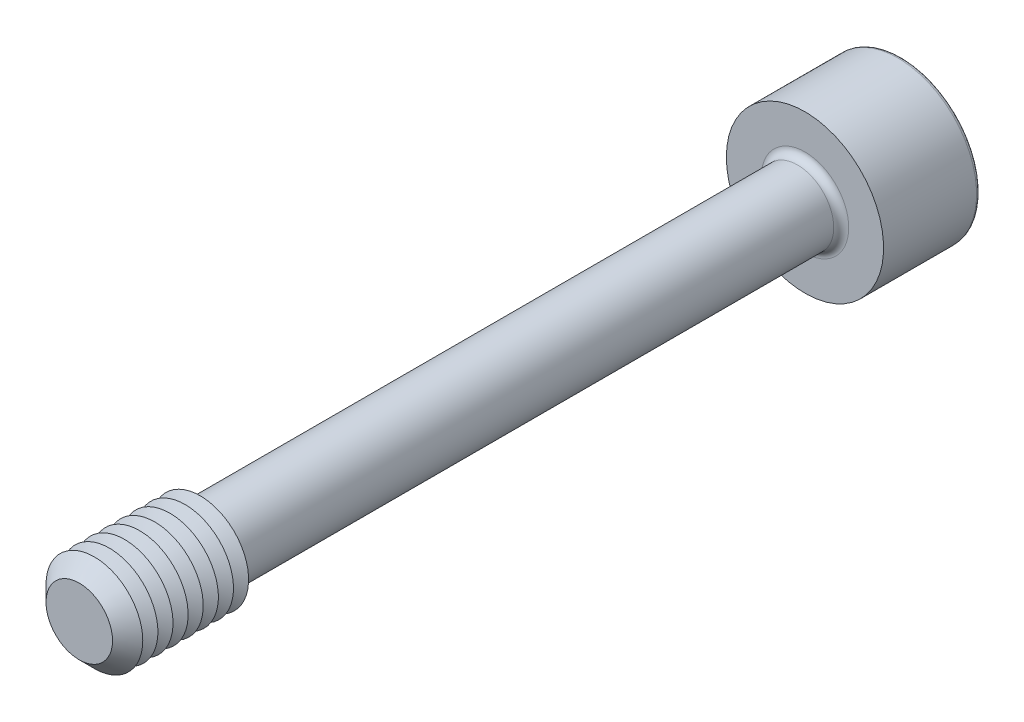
ISO-10303-21;
HEADER;
FILE_DESCRIPTION(('STEP AP214'),'2;1');
FILE_NAME('part.step','',(''),(''),'','','');
FILE_SCHEMA(('AUTOMOTIVE_DESIGN { 1 0 10303 214 1 1 1 1 }'));
ENDSEC;
DATA;
#1=APPLICATION_CONTEXT('core data for automotive mechanical design processes');
#2=APPLICATION_PROTOCOL_DEFINITION('international standard','automotive_design',2000,#1);
#3=PRODUCT_CONTEXT('',#1,'mechanical');
#4=PRODUCT('Part','Part','',(#3));
#5=PRODUCT_RELATED_PRODUCT_CATEGORY('part','',(#4));
#6=PRODUCT_DEFINITION_FORMATION('','',#4);
#7=PRODUCT_DEFINITION_CONTEXT('part definition',#1,'design');
#8=PRODUCT_DEFINITION('design','',#6,#7);
#9=PRODUCT_DEFINITION_SHAPE('','',#8);
#10=(LENGTH_UNIT() NAMED_UNIT(*) SI_UNIT(.MILLI.,.METRE.));
#11=(NAMED_UNIT(*) PLANE_ANGLE_UNIT() SI_UNIT($,.RADIAN.));
#12=(NAMED_UNIT(*) SI_UNIT($,.STERADIAN.) SOLID_ANGLE_UNIT());
#13=UNCERTAINTY_MEASURE_WITH_UNIT(LENGTH_MEASURE(1.E-05),#10,'distance_accuracy_value','');
#14=(GEOMETRIC_REPRESENTATION_CONTEXT(3) GLOBAL_UNCERTAINTY_ASSIGNED_CONTEXT((#13)) GLOBAL_UNIT_ASSIGNED_CONTEXT((#10,
#11,#12)) REPRESENTATION_CONTEXT('',''));
#15=CARTESIAN_POINT('',(0.,0.,0.));
#16=DIRECTION('',(0.,0.,1.));
#17=DIRECTION('',(1.,0.,0.));
#18=AXIS2_PLACEMENT_3D('',#15,#16,#17);
#19=CARTESIAN_POINT('',(-1.73205080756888,-3.,-32.));
#20=DIRECTION('',(0.,0.,1.));
#21=DIRECTION('',(1.,0.,0.));
#22=AXIS2_PLACEMENT_3D('',#19,#20,#21);
#23=PLANE('',#22);
#24=DIRECTION('',(1.,0.,0.));
#25=VECTOR('',#24,1.);
#26=CARTESIAN_POINT('',(-1.73205080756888,-3.,-32.));
#27=LINE('',#26,#25);
#28=CARTESIAN_POINT('',(0.,-3.,-32.));
#29=VERTEX_POINT('',#28);
#30=CARTESIAN_POINT('',(1.73205080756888,-3.,-32.));
#31=VERTEX_POINT('',#30);
#32=EDGE_CURVE('E406',#29,#31,#27,.T.);
#33=ORIENTED_EDGE('',*,*,#32,.F.);
#34=CARTESIAN_POINT('',(0.,0.,-32.));
#35=DIRECTION('',(0.,0.,1.));
#36=DIRECTION('',(0.,-1.,0.));
#37=AXIS2_PLACEMENT_3D('',#34,#35,#36);
#38=CIRCLE('',#37,3.);
#39=CARTESIAN_POINT('',(2.59807621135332,-1.5,-32.));
#40=VERTEX_POINT('',#39);
#41=EDGE_CURVE('E53',#29,#40,#38,.T.);
#42=ORIENTED_EDGE('',*,*,#41,.T.);
#43=DIRECTION('',(0.5,0.866025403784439,0.));
#44=VECTOR('',#43,1.);
#45=CARTESIAN_POINT('',(1.73205080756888,-3.,-32.));
#46=LINE('',#45,#44);
#47=EDGE_CURVE('E396',#31,#40,#46,.T.);
#48=ORIENTED_EDGE('',*,*,#47,.F.);
#49=EDGE_LOOP('',(#33,#42,#48));
#50=FACE_BOUND('',#49,.T.);
#51=ADVANCED_FACE('F41',(#50),#23,.F.);
#52=CARTESIAN_POINT('',(3.46410161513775,0.,-32.));
#53=VERTEX_POINT('',#52);
#54=EDGE_CURVE('E400',#40,#53,#46,.T.);
#55=ORIENTED_EDGE('',*,*,#54,.F.);
#56=CARTESIAN_POINT('',(2.59807621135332,1.5,-32.));
#57=VERTEX_POINT('',#56);
#58=EDGE_CURVE('E11',#40,#57,#38,.T.);
#59=ORIENTED_EDGE('',*,*,#58,.T.);
#60=DIRECTION('',(-0.5,0.866025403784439,0.));
#61=VECTOR('',#60,1.);
#62=CARTESIAN_POINT('',(3.46410161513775,0.,-32.));
#63=LINE('',#62,#61);
#64=EDGE_CURVE('E392',#53,#57,#63,.T.);
#65=ORIENTED_EDGE('',*,*,#64,.F.);
#66=EDGE_LOOP('',(#55,#59,#65));
#67=FACE_BOUND('',#66,.T.);
#68=ADVANCED_FACE('F133',(#67),#23,.F.);
#69=CARTESIAN_POINT('',(1.73205080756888,3.,-32.));
#70=VERTEX_POINT('',#69);
#71=EDGE_CURVE('E391',#57,#70,#63,.T.);
#72=ORIENTED_EDGE('',*,*,#71,.F.);
#73=CARTESIAN_POINT('',(0.,3.,-32.));
#74=VERTEX_POINT('',#73);
#75=EDGE_CURVE('E51',#57,#74,#38,.T.);
#76=ORIENTED_EDGE('',*,*,#75,.T.);
#77=DIRECTION('',(-1.,0.,0.));
#78=VECTOR('',#77,1.);
#79=CARTESIAN_POINT('',(1.73205080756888,3.,-32.));
#80=LINE('',#79,#78);
#81=EDGE_CURVE('E177',#70,#74,#80,.T.);
#82=ORIENTED_EDGE('',*,*,#81,.F.);
#83=EDGE_LOOP('',(#72,#76,#82));
#84=FACE_BOUND('',#83,.T.);
#85=ADVANCED_FACE('F139',(#84),#23,.F.);
#86=CARTESIAN_POINT('',(-1.73205080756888,3.,-32.));
#87=VERTEX_POINT('',#86);
#88=EDGE_CURVE('E397',#74,#87,#80,.T.);
#89=ORIENTED_EDGE('',*,*,#88,.F.);
#90=CARTESIAN_POINT('',(-2.59807621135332,1.5,-32.));
#91=VERTEX_POINT('',#90);
#92=EDGE_CURVE('E265',#74,#91,#38,.T.);
#93=ORIENTED_EDGE('',*,*,#92,.T.);
#94=DIRECTION('',(-0.5,-0.866025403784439,0.));
#95=VECTOR('',#94,1.);
#96=CARTESIAN_POINT('',(-1.73205080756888,3.,-32.));
#97=LINE('',#96,#95);
#98=EDGE_CURVE('E176',#87,#91,#97,.T.);
#99=ORIENTED_EDGE('',*,*,#98,.F.);
#100=EDGE_LOOP('',(#89,#93,#99));
#101=FACE_BOUND('',#100,.T.);
#102=ADVANCED_FACE('F157',(#101),#23,.F.);
#103=CARTESIAN_POINT('',(-3.46410161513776,0.,-32.));
#104=VERTEX_POINT('',#103);
#105=EDGE_CURVE('E170',#91,#104,#97,.T.);
#106=ORIENTED_EDGE('',*,*,#105,.F.);
#107=CARTESIAN_POINT('',(-2.59807621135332,-1.5,-32.));
#108=VERTEX_POINT('',#107);
#109=EDGE_CURVE('E172',#91,#108,#38,.T.);
#110=ORIENTED_EDGE('',*,*,#109,.T.);
#111=DIRECTION('',(0.5,-0.866025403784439,0.));
#112=VECTOR('',#111,1.);
#113=CARTESIAN_POINT('',(-3.46410161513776,0.,-32.));
#114=LINE('',#113,#112);
#115=EDGE_CURVE('E174',#104,#108,#114,.T.);
#116=ORIENTED_EDGE('',*,*,#115,.F.);
#117=EDGE_LOOP('',(#106,#110,#116));
#118=FACE_BOUND('',#117,.T.);
#119=ADVANCED_FACE('F146',(#118),#23,.F.);
#120=CARTESIAN_POINT('',(0.,0.,-38.));
#121=DIRECTION('',(0.,0.,-1.));
#122=DIRECTION('',(-1.,0.,0.));
#123=AXIS2_PLACEMENT_3D('',#120,#121,#122);
#124=PLANE('',#123);
#125=CARTESIAN_POINT('',(0.,0.,-38.));
#126=DIRECTION('',(0.,0.,-1.));
#127=DIRECTION('',(-1.,0.,0.));
#128=AXIS2_PLACEMENT_3D('',#125,#126,#127);
#129=CIRCLE('',#128,6.19);
#130=CARTESIAN_POINT('',(-6.19,0.,-38.));
#131=VERTEX_POINT('',#130);
#132=EDGE_CURVE('E250',#131,#131,#129,.T.);
#133=ORIENTED_EDGE('',*,*,#132,.T.);
#134=EDGE_LOOP('',(#133));
#135=FACE_BOUND('',#134,.T.);
#136=DIRECTION('',(-0.5,-0.866025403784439,0.));
#137=VECTOR('',#136,1.);
#138=CARTESIAN_POINT('',(-1.73205080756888,3.,-38.));
#139=LINE('',#138,#137);
#140=CARTESIAN_POINT('',(-1.73205080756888,3.,-38.));
#141=VERTEX_POINT('',#140);
#142=CARTESIAN_POINT('',(-3.46410161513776,0.,-38.));
#143=VERTEX_POINT('',#142);
#144=EDGE_CURVE('E212',#141,#143,#139,.T.);
#145=ORIENTED_EDGE('',*,*,#144,.T.);
#146=DIRECTION('',(0.5,-0.866025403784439,0.));
#147=VECTOR('',#146,1.);
#148=CARTESIAN_POINT('',(-3.46410161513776,0.,-38.));
#149=LINE('',#148,#147);
#150=CARTESIAN_POINT('',(-1.73205080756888,-3.,-38.));
#151=VERTEX_POINT('',#150);
#152=EDGE_CURVE('E67',#143,#151,#149,.T.);
#153=ORIENTED_EDGE('',*,*,#152,.T.);
#154=DIRECTION('',(1.,0.,0.));
#155=VECTOR('',#154,1.);
#156=CARTESIAN_POINT('',(-1.73205080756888,-3.,-38.));
#157=LINE('',#156,#155);
#158=CARTESIAN_POINT('',(1.73205080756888,-3.,-38.));
#159=VERTEX_POINT('',#158);
#160=EDGE_CURVE('E196',#151,#159,#157,.T.);
#161=ORIENTED_EDGE('',*,*,#160,.T.);
#162=DIRECTION('',(0.5,0.866025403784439,0.));
#163=VECTOR('',#162,1.);
#164=CARTESIAN_POINT('',(1.73205080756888,-3.,-38.));
#165=LINE('',#164,#163);
#166=CARTESIAN_POINT('',(3.46410161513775,0.,-38.));
#167=VERTEX_POINT('',#166);
#168=EDGE_CURVE('E200',#159,#167,#165,.T.);
#169=ORIENTED_EDGE('',*,*,#168,.T.);
#170=DIRECTION('',(-0.5,0.866025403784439,0.));
#171=VECTOR('',#170,1.);
#172=CARTESIAN_POINT('',(3.46410161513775,0.,-38.));
#173=LINE('',#172,#171);
#174=CARTESIAN_POINT('',(1.73205080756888,3.,-38.));
#175=VERTEX_POINT('',#174);
#176=EDGE_CURVE('E204',#167,#175,#173,.T.);
#177=ORIENTED_EDGE('',*,*,#176,.T.);
#178=DIRECTION('',(-1.,0.,0.));
#179=VECTOR('',#178,1.);
#180=CARTESIAN_POINT('',(1.73205080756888,3.,-38.));
#181=LINE('',#180,#179);
#182=EDGE_CURVE('E208',#175,#141,#181,.T.);
#183=ORIENTED_EDGE('',*,*,#182,.T.);
#184=EDGE_LOOP('',(#145,#153,#161,#169,#177,#183));
#185=FACE_BOUND('',#184,.T.);
#186=ADVANCED_FACE('F156',(#135,#185),#124,.T.);
#187=CARTESIAN_POINT('',(0.,0.,30.));
#188=DIRECTION('',(0.,0.,-1.));
#189=DIRECTION('',(-1.,0.,0.));
#190=AXIS2_PLACEMENT_3D('',#187,#188,#189);
#191=CYLINDRICAL_SURFACE('',#190,3.);
#192=CARTESIAN_POINT('',(0.,0.,-29.38));
#193=DIRECTION('',(0.,0.,-1.));
#194=DIRECTION('',(-1.,0.,0.));
#195=AXIS2_PLACEMENT_3D('',#192,#193,#194);
#196=CIRCLE('',#195,3.);
#197=CARTESIAN_POINT('',(-3.,0.,-29.38));
#198=VERTEX_POINT('',#197);
#199=EDGE_CURVE('E247',#198,#198,#196,.F.);
#200=ORIENTED_EDGE('',*,*,#199,.T.);
#201=EDGE_LOOP('',(#200));
#202=FACE_BOUND('',#201,.T.);
#203=CARTESIAN_POINT('',(0.,0.,19.4226497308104));
#204=DIRECTION('',(0.,0.,-1.));
#205=DIRECTION('',(0.,1.,0.));
#206=AXIS2_PLACEMENT_3D('',#203,#204,#205);
#207=CIRCLE('',#206,3.);
#208=CARTESIAN_POINT('',(0.,3.,19.4226497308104));
#209=VERTEX_POINT('',#208);
#210=EDGE_CURVE('E235',#209,#209,#207,.T.);
#211=ORIENTED_EDGE('',*,*,#210,.T.);
#212=EDGE_LOOP('',(#211));
#213=FACE_BOUND('',#212,.T.);
#214=ADVANCED_FACE('F163',(#202,#213),#191,.T.);
#215=CARTESIAN_POINT('',(0.,0.,19.4226497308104));
#216=DIRECTION('',(0.,0.,1.));
#217=DIRECTION('',(0.,-1.,0.));
#218=AXIS2_PLACEMENT_3D('',#215,#216,#217);
#219=CONICAL_SURFACE('',#218,3.,1.0471975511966);
#220=CARTESIAN_POINT('',(0.,0.,20.));
#221=DIRECTION('',(0.,0.,-1.));
#222=DIRECTION('',(-1.,0.,0.));
#223=AXIS2_PLACEMENT_3D('',#220,#221,#222);
#224=CIRCLE('',#223,4.);
#225=CARTESIAN_POINT('',(-4.,0.,20.));
#226=VERTEX_POINT('',#225);
#227=EDGE_CURVE('E268',#226,#226,#224,.T.);
#228=ORIENTED_EDGE('',*,*,#227,.T.);
#229=EDGE_LOOP('',(#228));
#230=FACE_BOUND('',#229,.T.);
#231=ORIENTED_EDGE('',*,*,#210,.F.);
#232=EDGE_LOOP('',(#231));
#233=FACE_BOUND('',#232,.T.);
#234=ADVANCED_FACE('F349',(#230,#233),#219,.T.);
#235=CARTESIAN_POINT('',(0.,0.,-30.));
#236=DIRECTION('',(0.,0.,-1.));
#237=DIRECTION('',(-1.,0.,0.));
#238=AXIS2_PLACEMENT_3D('',#235,#236,#237);
#239=PLANE('',#238);
#240=CARTESIAN_POINT('',(0.,0.,-30.));
#241=DIRECTION('',(0.,0.,-1.));
#242=DIRECTION('',(-1.,0.,0.));
#243=AXIS2_PLACEMENT_3D('',#240,#241,#242);
#244=CIRCLE('',#243,3.62);
#245=CARTESIAN_POINT('',(-3.62,0.,-30.));
#246=VERTEX_POINT('',#245);
#247=EDGE_CURVE('E243',#246,#246,#244,.T.);
#248=ORIENTED_EDGE('',*,*,#247,.T.);
#249=EDGE_LOOP('',(#248));
#250=FACE_BOUND('',#249,.T.);
#251=CARTESIAN_POINT('',(0.,0.,-30.));
#252=DIRECTION('',(0.,0.,-1.));
#253=DIRECTION('',(-1.,0.,0.));
#254=AXIS2_PLACEMENT_3D('',#251,#252,#253);
#255=CIRCLE('',#254,6.5);
#256=CARTESIAN_POINT('',(-6.5,0.,-30.));
#257=VERTEX_POINT('',#256);
#258=EDGE_CURVE('E231',#257,#257,#255,.T.);
#259=ORIENTED_EDGE('',*,*,#258,.F.);
#260=EDGE_LOOP('',(#259));
#261=FACE_BOUND('',#260,.T.);
#262=ADVANCED_FACE('F354',(#250,#261),#239,.F.);
#263=CARTESIAN_POINT('',(0.,0.,-38.));
#264=DIRECTION('',(0.,0.,1.));
#265=DIRECTION('',(1.,0.,0.));
#266=AXIS2_PLACEMENT_3D('',#263,#264,#265);
#267=CYLINDRICAL_SURFACE('',#266,6.5);
#268=CARTESIAN_POINT('',(0.,0.,-37.69));
#269=DIRECTION('',(0.,0.,-1.));
#270=DIRECTION('',(-1.,0.,0.));
#271=AXIS2_PLACEMENT_3D('',#268,#269,#270);
#272=CIRCLE('',#271,6.5);
#273=CARTESIAN_POINT('',(-6.5,0.,-37.69));
#274=VERTEX_POINT('',#273);
#275=EDGE_CURVE('E45',#274,#274,#272,.F.);
#276=ORIENTED_EDGE('',*,*,#275,.T.);
#277=EDGE_LOOP('',(#276));
#278=FACE_BOUND('',#277,.T.);
#279=ORIENTED_EDGE('',*,*,#258,.T.);
#280=EDGE_LOOP('',(#279));
#281=FACE_BOUND('',#280,.T.);
#282=ADVANCED_FACE('F355',(#278,#281),#267,.T.);
#283=CARTESIAN_POINT('',(-3.46410161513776,0.,-32.));
#284=DIRECTION('',(0.866025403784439,0.5,0.));
#285=DIRECTION('',(-0.5,0.866025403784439,0.));
#286=AXIS2_PLACEMENT_3D('',#283,#284,#285);
#287=PLANE('',#286);
#288=ORIENTED_EDGE('',*,*,#152,.F.);
#289=DIRECTION('',(0.,0.,-1.));
#290=VECTOR('',#289,1.);
#291=CARTESIAN_POINT('',(-3.46410161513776,0.,-32.));
#292=LINE('',#291,#290);
#293=EDGE_CURVE('E186',#104,#143,#292,.T.);
#294=ORIENTED_EDGE('',*,*,#293,.F.);
#295=ORIENTED_EDGE('',*,*,#115,.T.);
#296=CARTESIAN_POINT('',(-1.73205080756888,-3.,-32.));
#297=VERTEX_POINT('',#296);
#298=EDGE_CURVE('E215',#108,#297,#114,.T.);
#299=ORIENTED_EDGE('',*,*,#298,.T.);
#300=DIRECTION('',(0.,0.,-1.));
#301=VECTOR('',#300,1.);
#302=CARTESIAN_POINT('',(-1.73205080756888,-3.,-32.));
#303=LINE('',#302,#301);
#304=EDGE_CURVE('E228',#297,#151,#303,.T.);
#305=ORIENTED_EDGE('',*,*,#304,.T.);
#306=EDGE_LOOP('',(#288,#294,#295,#299,#305));
#307=FACE_BOUND('',#306,.T.);
#308=ADVANCED_FACE('F358',(#307),#287,.T.);
#309=CARTESIAN_POINT('',(-1.73205080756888,-3.,-32.));
#310=DIRECTION('',(0.,1.,0.));
#311=DIRECTION('',(0.,0.,1.));
#312=AXIS2_PLACEMENT_3D('',#309,#310,#311);
#313=PLANE('',#312);
#314=ORIENTED_EDGE('',*,*,#160,.F.);
#315=ORIENTED_EDGE('',*,*,#304,.F.);
#316=EDGE_CURVE('E403',#297,#29,#27,.T.);
#317=ORIENTED_EDGE('',*,*,#316,.T.);
#318=ORIENTED_EDGE('',*,*,#32,.T.);
#319=DIRECTION('',(0.,0.,-1.));
#320=VECTOR('',#319,1.);
#321=CARTESIAN_POINT('',(1.73205080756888,-3.,-32.));
#322=LINE('',#321,#320);
#323=EDGE_CURVE('E225',#31,#159,#322,.T.);
#324=ORIENTED_EDGE('',*,*,#323,.T.);
#325=EDGE_LOOP('',(#314,#315,#317,#318,#324));
#326=FACE_BOUND('',#325,.T.);
#327=ADVANCED_FACE('F364',(#326),#313,.T.);
#328=CARTESIAN_POINT('',(1.73205080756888,-3.,-32.));
#329=DIRECTION('',(-0.866025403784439,0.5,0.));
#330=DIRECTION('',(-0.5,-0.866025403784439,0.));
#331=AXIS2_PLACEMENT_3D('',#328,#329,#330);
#332=PLANE('',#331);
#333=ORIENTED_EDGE('',*,*,#168,.F.);
#334=ORIENTED_EDGE('',*,*,#323,.F.);
#335=ORIENTED_EDGE('',*,*,#47,.T.);
#336=ORIENTED_EDGE('',*,*,#54,.T.);
#337=DIRECTION('',(0.,0.,-1.));
#338=VECTOR('',#337,1.);
#339=CARTESIAN_POINT('',(3.46410161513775,0.,-32.));
#340=LINE('',#339,#338);
#341=EDGE_CURVE('E222',#53,#167,#340,.T.);
#342=ORIENTED_EDGE('',*,*,#341,.T.);
#343=EDGE_LOOP('',(#333,#334,#335,#336,#342));
#344=FACE_BOUND('',#343,.T.);
#345=ADVANCED_FACE('F367',(#344),#332,.T.);
#346=CARTESIAN_POINT('',(3.46410161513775,0.,-32.));
#347=DIRECTION('',(-0.866025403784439,-0.5,0.));
#348=DIRECTION('',(0.5,-0.866025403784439,0.));
#349=AXIS2_PLACEMENT_3D('',#346,#347,#348);
#350=PLANE('',#349);
#351=ORIENTED_EDGE('',*,*,#176,.F.);
#352=ORIENTED_EDGE('',*,*,#341,.F.);
#353=ORIENTED_EDGE('',*,*,#64,.T.);
#354=ORIENTED_EDGE('',*,*,#71,.T.);
#355=DIRECTION('',(0.,0.,-1.));
#356=VECTOR('',#355,1.);
#357=CARTESIAN_POINT('',(1.73205080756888,3.,-32.));
#358=LINE('',#357,#356);
#359=EDGE_CURVE('E219',#70,#175,#358,.T.);
#360=ORIENTED_EDGE('',*,*,#359,.T.);
#361=EDGE_LOOP('',(#351,#352,#353,#354,#360));
#362=FACE_BOUND('',#361,.T.);
#363=ADVANCED_FACE('F371',(#362),#350,.T.);
#364=CARTESIAN_POINT('',(1.73205080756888,3.,-32.));
#365=DIRECTION('',(0.,-1.,0.));
#366=DIRECTION('',(1.,0.,0.));
#367=AXIS2_PLACEMENT_3D('',#364,#365,#366);
#368=PLANE('',#367);
#369=ORIENTED_EDGE('',*,*,#182,.F.);
#370=ORIENTED_EDGE('',*,*,#359,.F.);
#371=ORIENTED_EDGE('',*,*,#81,.T.);
#372=ORIENTED_EDGE('',*,*,#88,.T.);
#373=DIRECTION('',(0.,0.,-1.));
#374=VECTOR('',#373,1.);
#375=CARTESIAN_POINT('',(-1.73205080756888,3.,-32.));
#376=LINE('',#375,#374);
#377=EDGE_CURVE('E182',#87,#141,#376,.T.);
#378=ORIENTED_EDGE('',*,*,#377,.T.);
#379=EDGE_LOOP('',(#369,#370,#371,#372,#378));
#380=FACE_BOUND('',#379,.T.);
#381=ADVANCED_FACE('F152',(#380),#368,.T.);
#382=CARTESIAN_POINT('',(-1.73205080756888,3.,-32.));
#383=DIRECTION('',(0.866025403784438,-0.5,0.));
#384=DIRECTION('',(0.5,0.866025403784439,0.));
#385=AXIS2_PLACEMENT_3D('',#382,#383,#384);
#386=PLANE('',#385);
#387=ORIENTED_EDGE('',*,*,#144,.F.);
#388=ORIENTED_EDGE('',*,*,#377,.F.);
#389=ORIENTED_EDGE('',*,*,#98,.T.);
#390=ORIENTED_EDGE('',*,*,#105,.T.);
#391=ORIENTED_EDGE('',*,*,#293,.T.);
#392=EDGE_LOOP('',(#387,#388,#389,#390,#391));
#393=FACE_BOUND('',#392,.T.);
#394=ADVANCED_FACE('F144',(#393),#386,.T.);
#395=ORIENTED_EDGE('',*,*,#298,.F.);
#396=EDGE_CURVE('E257',#108,#29,#38,.T.);
#397=ORIENTED_EDGE('',*,*,#396,.T.);
#398=ORIENTED_EDGE('',*,*,#316,.F.);
#399=EDGE_LOOP('',(#395,#397,#398));
#400=FACE_BOUND('',#399,.T.);
#401=ADVANCED_FACE('F135',(#400),#23,.F.);
#402=CARTESIAN_POINT('',(0.,0.,-29.38));
#403=DIRECTION('',(0.,0.,-1.));
#404=DIRECTION('',(-1.,0.,0.));
#405=AXIS2_PLACEMENT_3D('',#402,#403,#404);
#406=TOROIDAL_SURFACE('',#405,3.62,0.62);
#407=ORIENTED_EDGE('',*,*,#199,.F.);
#408=EDGE_LOOP('',(#407));
#409=FACE_BOUND('',#408,.T.);
#410=ORIENTED_EDGE('',*,*,#247,.F.);
#411=EDGE_LOOP('',(#410));
#412=FACE_BOUND('',#411,.T.);
#413=ADVANCED_FACE('F129',(#409,#412),#406,.F.);
#414=CARTESIAN_POINT('',(0.,0.,-37.69));
#415=DIRECTION('',(0.,0.,-1.));
#416=DIRECTION('',(-1.,0.,0.));
#417=AXIS2_PLACEMENT_3D('',#414,#415,#416);
#418=TOROIDAL_SURFACE('',#417,6.19,0.31);
#419=ORIENTED_EDGE('',*,*,#275,.F.);
#420=EDGE_LOOP('',(#419));
#421=FACE_BOUND('',#420,.T.);
#422=ORIENTED_EDGE('',*,*,#132,.F.);
#423=EDGE_LOOP('',(#422));
#424=FACE_BOUND('',#423,.T.);
#425=ADVANCED_FACE('F43',(#421,#424),#418,.T.);
#426=CARTESIAN_POINT('',(0.,0.,-30.2679491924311));
#427=DIRECTION('',(0.,0.,-1.));
#428=DIRECTION('',(0.,1.,0.));
#429=AXIS2_PLACEMENT_3D('',#426,#427,#428);
#430=CONICAL_SURFACE('',#429,0.,1.04719755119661);
#431=ORIENTED_EDGE('',*,*,#41,.F.);
#432=ORIENTED_EDGE('',*,*,#396,.F.);
#433=ORIENTED_EDGE('',*,*,#109,.F.);
#434=ORIENTED_EDGE('',*,*,#92,.F.);
#435=ORIENTED_EDGE('',*,*,#75,.F.);
#436=ORIENTED_EDGE('',*,*,#58,.F.);
#437=EDGE_LOOP('',(#431,#432,#433,#434,#435,#436));
#438=FACE_BOUND('',#437,.T.);
#439=CARTESIAN_POINT('',(0.,0.,-30.2679491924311));
#440=VERTEX_POINT('',#439);
#441=VERTEX_LOOP('',#440);
#442=FACE_BOUND('',#441,.T.);
#443=ADVANCED_FACE('F118',(#438,#442),#430,.F.);
#444=CARTESIAN_POINT('',(0.,0.,20.625));
#445=DIRECTION('',(0.,0.,-1.));
#446=DIRECTION('',(-1.,0.,0.));
#447=AXIS2_PLACEMENT_3D('',#444,#445,#446);
#448=CONICAL_SURFACE('',#447,2.91746824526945,1.0471975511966);
#449=ORIENTED_EDGE('',*,*,#227,.F.);
#450=EDGE_LOOP('',(#449));
#451=FACE_BOUND('',#450,.T.);
#452=CARTESIAN_POINT('',(0.,0.,20.625));
#453=DIRECTION('',(0.,0.,-1.));
#454=DIRECTION('',(-1.,0.,0.));
#455=AXIS2_PLACEMENT_3D('',#452,#453,#454);
#456=CIRCLE('',#455,2.91746824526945);
#457=CARTESIAN_POINT('',(-2.91746824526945,0.,20.625));
#458=VERTEX_POINT('',#457);
#459=EDGE_CURVE('E273',#458,#458,#456,.T.);
#460=ORIENTED_EDGE('',*,*,#459,.T.);
#461=EDGE_LOOP('',(#460));
#462=FACE_BOUND('',#461,.T.);
#463=ADVANCED_FACE('F120',(#451,#462),#448,.T.);
#464=CARTESIAN_POINT('',(0.,0.,21.25));
#465=DIRECTION('',(0.,0.,1.));
#466=DIRECTION('',(1.,0.,0.));
#467=AXIS2_PLACEMENT_3D('',#464,#465,#466);
#468=CONICAL_SURFACE('',#467,4.,1.04719755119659);
#469=ORIENTED_EDGE('',*,*,#459,.F.);
#470=EDGE_LOOP('',(#469));
#471=FACE_BOUND('',#470,.T.);
#472=CARTESIAN_POINT('',(0.,0.,21.25));
#473=DIRECTION('',(0.,0.,-1.));
#474=DIRECTION('',(-1.,0.,0.));
#475=AXIS2_PLACEMENT_3D('',#472,#473,#474);
#476=CIRCLE('',#475,4.);
#477=CARTESIAN_POINT('',(-4.,0.,21.25));
#478=VERTEX_POINT('',#477);
#479=EDGE_CURVE('E279',#478,#478,#476,.T.);
#480=ORIENTED_EDGE('',*,*,#479,.T.);
#481=EDGE_LOOP('',(#480));
#482=FACE_BOUND('',#481,.T.);
#483=ADVANCED_FACE('F126',(#471,#482),#468,.T.);
#484=CARTESIAN_POINT('',(0.,0.,21.875));
#485=DIRECTION('',(0.,0.,-1.));
#486=DIRECTION('',(-1.,0.,0.));
#487=AXIS2_PLACEMENT_3D('',#484,#485,#486);
#488=CONICAL_SURFACE('',#487,2.91746824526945,1.0471975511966);
#489=ORIENTED_EDGE('',*,*,#479,.F.);
#490=EDGE_LOOP('',(#489));
#491=FACE_BOUND('',#490,.T.);
#492=CARTESIAN_POINT('',(0.,0.,21.875));
#493=DIRECTION('',(0.,0.,-1.));
#494=DIRECTION('',(-1.,0.,0.));
#495=AXIS2_PLACEMENT_3D('',#492,#493,#494);
#496=CIRCLE('',#495,2.91746824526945);
#497=CARTESIAN_POINT('',(-2.91746824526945,0.,21.875));
#498=VERTEX_POINT('',#497);
#499=EDGE_CURVE('E285',#498,#498,#496,.T.);
#500=ORIENTED_EDGE('',*,*,#499,.T.);
#501=EDGE_LOOP('',(#500));
#502=FACE_BOUND('',#501,.T.);
#503=ADVANCED_FACE('F508',(#491,#502),#488,.T.);
#504=CARTESIAN_POINT('',(0.,0.,22.5));
#505=DIRECTION('',(0.,0.,1.));
#506=DIRECTION('',(1.,0.,0.));
#507=AXIS2_PLACEMENT_3D('',#504,#505,#506);
#508=CONICAL_SURFACE('',#507,4.,1.04719755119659);
#509=ORIENTED_EDGE('',*,*,#499,.F.);
#510=EDGE_LOOP('',(#509));
#511=FACE_BOUND('',#510,.T.);
#512=CARTESIAN_POINT('',(0.,0.,22.5));
#513=DIRECTION('',(0.,0.,-1.));
#514=DIRECTION('',(-1.,0.,0.));
#515=AXIS2_PLACEMENT_3D('',#512,#513,#514);
#516=CIRCLE('',#515,4.);
#517=CARTESIAN_POINT('',(-4.,0.,22.5));
#518=VERTEX_POINT('',#517);
#519=EDGE_CURVE('E288',#518,#518,#516,.T.);
#520=ORIENTED_EDGE('',*,*,#519,.T.);
#521=EDGE_LOOP('',(#520));
#522=FACE_BOUND('',#521,.T.);
#523=ADVANCED_FACE('F517',(#511,#522),#508,.T.);
#524=CARTESIAN_POINT('',(0.,0.,23.125));
#525=DIRECTION('',(0.,0.,-1.));
#526=DIRECTION('',(-1.,0.,0.));
#527=AXIS2_PLACEMENT_3D('',#524,#525,#526);
#528=CONICAL_SURFACE('',#527,2.91746824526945,1.0471975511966);
#529=ORIENTED_EDGE('',*,*,#519,.F.);
#530=EDGE_LOOP('',(#529));
#531=FACE_BOUND('',#530,.T.);
#532=CARTESIAN_POINT('',(0.,0.,23.125));
#533=DIRECTION('',(0.,0.,-1.));
#534=DIRECTION('',(-1.,0.,0.));
#535=AXIS2_PLACEMENT_3D('',#532,#533,#534);
#536=CIRCLE('',#535,2.91746824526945);
#537=CARTESIAN_POINT('',(-2.91746824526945,0.,23.125));
#538=VERTEX_POINT('',#537);
#539=EDGE_CURVE('E292',#538,#538,#536,.T.);
#540=ORIENTED_EDGE('',*,*,#539,.T.);
#541=EDGE_LOOP('',(#540));
#542=FACE_BOUND('',#541,.T.);
#543=ADVANCED_FACE('F526',(#531,#542),#528,.T.);
#544=CARTESIAN_POINT('',(0.,0.,23.75));
#545=DIRECTION('',(0.,0.,1.));
#546=DIRECTION('',(1.,0.,0.));
#547=AXIS2_PLACEMENT_3D('',#544,#545,#546);
#548=CONICAL_SURFACE('',#547,4.,1.04719755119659);
#549=ORIENTED_EDGE('',*,*,#539,.F.);
#550=EDGE_LOOP('',(#549));
#551=FACE_BOUND('',#550,.T.);
#552=CARTESIAN_POINT('',(0.,0.,23.75));
#553=DIRECTION('',(0.,0.,-1.));
#554=DIRECTION('',(-1.,0.,0.));
#555=AXIS2_PLACEMENT_3D('',#552,#553,#554);
#556=CIRCLE('',#555,4.);
#557=CARTESIAN_POINT('',(-4.,0.,23.75));
#558=VERTEX_POINT('',#557);
#559=EDGE_CURVE('E296',#558,#558,#556,.T.);
#560=ORIENTED_EDGE('',*,*,#559,.T.);
#561=EDGE_LOOP('',(#560));
#562=FACE_BOUND('',#561,.T.);
#563=ADVANCED_FACE('F535',(#551,#562),#548,.T.);
#564=CARTESIAN_POINT('',(0.,0.,24.375));
#565=DIRECTION('',(0.,0.,-1.));
#566=DIRECTION('',(-1.,0.,0.));
#567=AXIS2_PLACEMENT_3D('',#564,#565,#566);
#568=CONICAL_SURFACE('',#567,2.91746824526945,1.0471975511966);
#569=ORIENTED_EDGE('',*,*,#559,.F.);
#570=EDGE_LOOP('',(#569));
#571=FACE_BOUND('',#570,.T.);
#572=CARTESIAN_POINT('',(0.,0.,24.375));
#573=DIRECTION('',(0.,0.,-1.));
#574=DIRECTION('',(-1.,0.,0.));
#575=AXIS2_PLACEMENT_3D('',#572,#573,#574);
#576=CIRCLE('',#575,2.91746824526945);
#577=CARTESIAN_POINT('',(-2.91746824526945,0.,24.375));
#578=VERTEX_POINT('',#577);
#579=EDGE_CURVE('E300',#578,#578,#576,.T.);
#580=ORIENTED_EDGE('',*,*,#579,.T.);
#581=EDGE_LOOP('',(#580));
#582=FACE_BOUND('',#581,.T.);
#583=ADVANCED_FACE('F544',(#571,#582),#568,.T.);
#584=CARTESIAN_POINT('',(0.,0.,25.));
#585=DIRECTION('',(0.,0.,1.));
#586=DIRECTION('',(1.,0.,0.));
#587=AXIS2_PLACEMENT_3D('',#584,#585,#586);
#588=CONICAL_SURFACE('',#587,4.,1.04719755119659);
#589=ORIENTED_EDGE('',*,*,#579,.F.);
#590=EDGE_LOOP('',(#589));
#591=FACE_BOUND('',#590,.T.);
#592=CARTESIAN_POINT('',(0.,0.,25.));
#593=DIRECTION('',(0.,0.,-1.));
#594=DIRECTION('',(-1.,0.,0.));
#595=AXIS2_PLACEMENT_3D('',#592,#593,#594);
#596=CIRCLE('',#595,4.);
#597=CARTESIAN_POINT('',(-4.,0.,25.));
#598=VERTEX_POINT('',#597);
#599=EDGE_CURVE('E304',#598,#598,#596,.T.);
#600=ORIENTED_EDGE('',*,*,#599,.T.);
#601=EDGE_LOOP('',(#600));
#602=FACE_BOUND('',#601,.T.);
#603=ADVANCED_FACE('F553',(#591,#602),#588,.T.);
#604=CARTESIAN_POINT('',(0.,0.,25.625));
#605=DIRECTION('',(0.,0.,-1.));
#606=DIRECTION('',(-1.,0.,0.));
#607=AXIS2_PLACEMENT_3D('',#604,#605,#606);
#608=CONICAL_SURFACE('',#607,2.91746824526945,1.0471975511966);
#609=ORIENTED_EDGE('',*,*,#599,.F.);
#610=EDGE_LOOP('',(#609));
#611=FACE_BOUND('',#610,.T.);
#612=CARTESIAN_POINT('',(0.,0.,25.625));
#613=DIRECTION('',(0.,0.,-1.));
#614=DIRECTION('',(-1.,0.,0.));
#615=AXIS2_PLACEMENT_3D('',#612,#613,#614);
#616=CIRCLE('',#615,2.91746824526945);
#617=CARTESIAN_POINT('',(-2.91746824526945,0.,25.625));
#618=VERTEX_POINT('',#617);
#619=EDGE_CURVE('E308',#618,#618,#616,.T.);
#620=ORIENTED_EDGE('',*,*,#619,.T.);
#621=EDGE_LOOP('',(#620));
#622=FACE_BOUND('',#621,.T.);
#623=ADVANCED_FACE('F562',(#611,#622),#608,.T.);
#624=CARTESIAN_POINT('',(0.,0.,26.25));
#625=DIRECTION('',(0.,0.,1.));
#626=DIRECTION('',(1.,0.,0.));
#627=AXIS2_PLACEMENT_3D('',#624,#625,#626);
#628=CONICAL_SURFACE('',#627,4.,1.04719755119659);
#629=ORIENTED_EDGE('',*,*,#619,.F.);
#630=EDGE_LOOP('',(#629));
#631=FACE_BOUND('',#630,.T.);
#632=CARTESIAN_POINT('',(0.,0.,26.25));
#633=DIRECTION('',(0.,0.,-1.));
#634=DIRECTION('',(-1.,0.,0.));
#635=AXIS2_PLACEMENT_3D('',#632,#633,#634);
#636=CIRCLE('',#635,4.);
#637=CARTESIAN_POINT('',(-4.,0.,26.25));
#638=VERTEX_POINT('',#637);
#639=EDGE_CURVE('E312',#638,#638,#636,.T.);
#640=ORIENTED_EDGE('',*,*,#639,.T.);
#641=EDGE_LOOP('',(#640));
#642=FACE_BOUND('',#641,.T.);
#643=ADVANCED_FACE('F571',(#631,#642),#628,.T.);
#644=CARTESIAN_POINT('',(0.,0.,26.875));
#645=DIRECTION('',(0.,0.,-1.));
#646=DIRECTION('',(-1.,0.,0.));
#647=AXIS2_PLACEMENT_3D('',#644,#645,#646);
#648=CONICAL_SURFACE('',#647,2.91746824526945,1.0471975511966);
#649=ORIENTED_EDGE('',*,*,#639,.F.);
#650=EDGE_LOOP('',(#649));
#651=FACE_BOUND('',#650,.T.);
#652=CARTESIAN_POINT('',(0.,0.,26.875));
#653=DIRECTION('',(0.,0.,-1.));
#654=DIRECTION('',(-1.,0.,0.));
#655=AXIS2_PLACEMENT_3D('',#652,#653,#654);
#656=CIRCLE('',#655,2.91746824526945);
#657=CARTESIAN_POINT('',(-2.91746824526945,0.,26.875));
#658=VERTEX_POINT('',#657);
#659=EDGE_CURVE('E316',#658,#658,#656,.T.);
#660=ORIENTED_EDGE('',*,*,#659,.T.);
#661=EDGE_LOOP('',(#660));
#662=FACE_BOUND('',#661,.T.);
#663=ADVANCED_FACE('F580',(#651,#662),#648,.T.);
#664=CARTESIAN_POINT('',(0.,0.,27.5));
#665=DIRECTION('',(0.,0.,1.));
#666=DIRECTION('',(1.,0.,0.));
#667=AXIS2_PLACEMENT_3D('',#664,#665,#666);
#668=CONICAL_SURFACE('',#667,4.,1.04719755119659);
#669=ORIENTED_EDGE('',*,*,#659,.F.);
#670=EDGE_LOOP('',(#669));
#671=FACE_BOUND('',#670,.T.);
#672=CARTESIAN_POINT('',(0.,0.,27.5));
#673=DIRECTION('',(0.,0.,-1.));
#674=DIRECTION('',(-1.,0.,0.));
#675=AXIS2_PLACEMENT_3D('',#672,#673,#674);
#676=CIRCLE('',#675,4.);
#677=CARTESIAN_POINT('',(-4.,0.,27.5));
#678=VERTEX_POINT('',#677);
#679=EDGE_CURVE('E320',#678,#678,#676,.T.);
#680=ORIENTED_EDGE('',*,*,#679,.T.);
#681=EDGE_LOOP('',(#680));
#682=FACE_BOUND('',#681,.T.);
#683=ADVANCED_FACE('F589',(#671,#682),#668,.T.);
#684=CARTESIAN_POINT('',(0.,0.,28.125));
#685=DIRECTION('',(0.,0.,-1.));
#686=DIRECTION('',(-1.,0.,0.));
#687=AXIS2_PLACEMENT_3D('',#684,#685,#686);
#688=CONICAL_SURFACE('',#687,2.91746824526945,1.0471975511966);
#689=ORIENTED_EDGE('',*,*,#679,.F.);
#690=EDGE_LOOP('',(#689));
#691=FACE_BOUND('',#690,.T.);
#692=CARTESIAN_POINT('',(0.,0.,28.125));
#693=DIRECTION('',(0.,0.,-1.));
#694=DIRECTION('',(-1.,0.,0.));
#695=AXIS2_PLACEMENT_3D('',#692,#693,#694);
#696=CIRCLE('',#695,2.91746824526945);
#697=CARTESIAN_POINT('',(-2.91746824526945,0.,28.125));
#698=VERTEX_POINT('',#697);
#699=EDGE_CURVE('E324',#698,#698,#696,.T.);
#700=ORIENTED_EDGE('',*,*,#699,.T.);
#701=EDGE_LOOP('',(#700));
#702=FACE_BOUND('',#701,.T.);
#703=ADVANCED_FACE('F598',(#691,#702),#688,.T.);
#704=CARTESIAN_POINT('',(0.,0.,28.75));
#705=DIRECTION('',(0.,0.,1.));
#706=DIRECTION('',(1.,0.,0.));
#707=AXIS2_PLACEMENT_3D('',#704,#705,#706);
#708=CONICAL_SURFACE('',#707,4.,1.04719755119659);
#709=ORIENTED_EDGE('',*,*,#699,.F.);
#710=EDGE_LOOP('',(#709));
#711=FACE_BOUND('',#710,.T.);
#712=CARTESIAN_POINT('',(0.,0.,28.75));
#713=DIRECTION('',(0.,0.,-1.));
#714=DIRECTION('',(-1.,0.,0.));
#715=AXIS2_PLACEMENT_3D('',#712,#713,#714);
#716=CIRCLE('',#715,4.);
#717=CARTESIAN_POINT('',(-4.,0.,28.75));
#718=VERTEX_POINT('',#717);
#719=EDGE_CURVE('E328',#718,#718,#716,.T.);
#720=ORIENTED_EDGE('',*,*,#719,.T.);
#721=EDGE_LOOP('',(#720));
#722=FACE_BOUND('',#721,.T.);
#723=ADVANCED_FACE('F334',(#711,#722),#708,.T.);
#724=CARTESIAN_POINT('',(0.,0.,30.));
#725=DIRECTION('',(0.,0.,1.));
#726=DIRECTION('',(1.,0.,0.));
#727=AXIS2_PLACEMENT_3D('',#724,#725,#726);
#728=PLANE('',#727);
#729=CARTESIAN_POINT('',(0.,0.,30.));
#730=DIRECTION('',(0.,0.,1.));
#731=DIRECTION('',(1.,0.,0.));
#732=AXIS2_PLACEMENT_3D('',#729,#730,#731);
#733=CIRCLE('',#732,2.75000000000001);
#734=CARTESIAN_POINT('',(2.75000000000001,0.,30.));
#735=VERTEX_POINT('',#734);
#736=EDGE_CURVE('E239',#735,#735,#733,.T.);
#737=ORIENTED_EDGE('',*,*,#736,.T.);
#738=EDGE_LOOP('',(#737));
#739=FACE_BOUND('',#738,.T.);
#740=ADVANCED_FACE('F338',(#739),#728,.T.);
#741=CARTESIAN_POINT('',(0.,0.,28.75));
#742=DIRECTION('',(0.,0.,-1.));
#743=DIRECTION('',(0.,1.,0.));
#744=AXIS2_PLACEMENT_3D('',#741,#742,#743);
#745=CONICAL_SURFACE('',#744,4.,0.78539816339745);
#746=ORIENTED_EDGE('',*,*,#736,.F.);
#747=EDGE_LOOP('',(#746));
#748=FACE_BOUND('',#747,.T.);
#749=ORIENTED_EDGE('',*,*,#719,.F.);
#750=EDGE_LOOP('',(#749));
#751=FACE_BOUND('',#750,.T.);
#752=ADVANCED_FACE('F336',(#748,#751),#745,.T.);
#753=CLOSED_SHELL('',(#51,#68,#85,#102,#119,#186,#214,#234,#262,#282,#308,#327,#345,#363,#381,
#394,#401,#413,#425,#443,#463,#483,#503,#523,#543,#563,#583,#603,#623,#643,#663,#683,#703,#723,
#740,#752));
#754=MANIFOLD_SOLID_BREP('B2',#753);
#755=ADVANCED_BREP_SHAPE_REPRESENTATION('',(#18,#754),#14);
#756=SHAPE_DEFINITION_REPRESENTATION(#9,#755);
ENDSEC;
END-ISO-10303-21;
